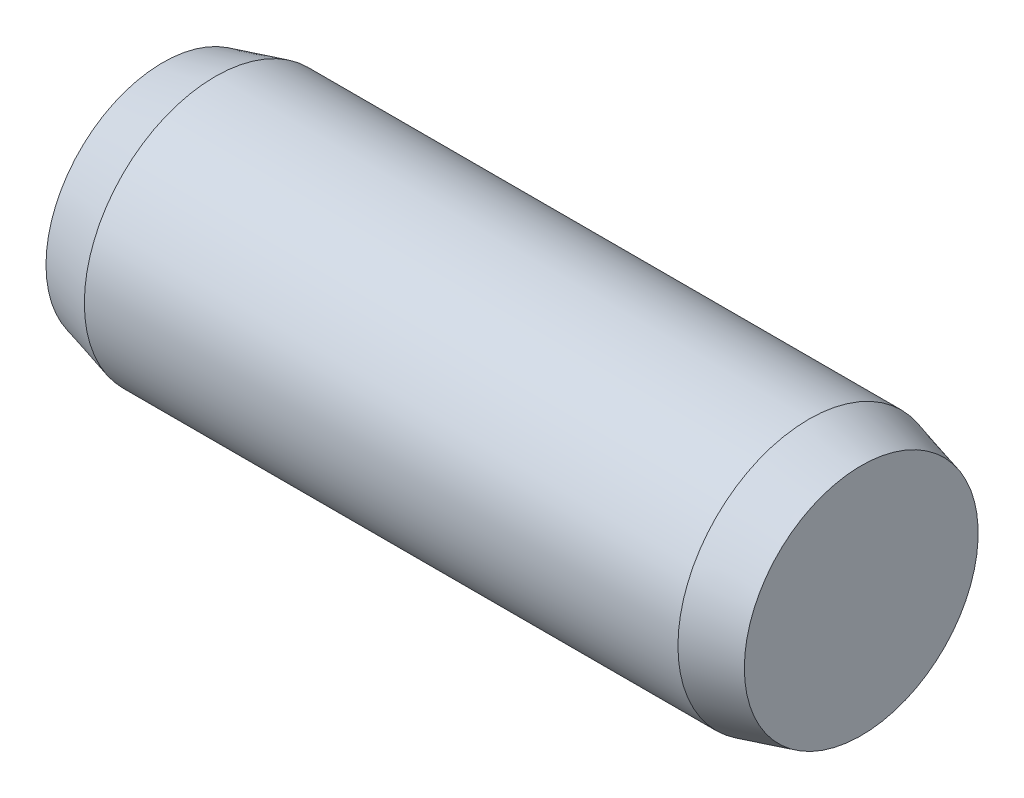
from build123d import *


with BuildPart() as part:
    # Sketch1 → Base-Revolve (revolve)
    with BuildSketch(Plane.XY, mode=Mode.PRIVATE) as base_revolve_sk:
        Polygon((0, 0), (4, 0), (4, 0.669615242), (3.7, 0.75), (0.3, 0.75), (0, 0.669615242), align=None)
    revolve(base_revolve_sk.sketch.rotate(Axis((-6.35, 0, 0), (1, 0, 0)), 90), axis=Axis((-6.35, 0, 0), (1, 0, 0)))


solid = part.part
